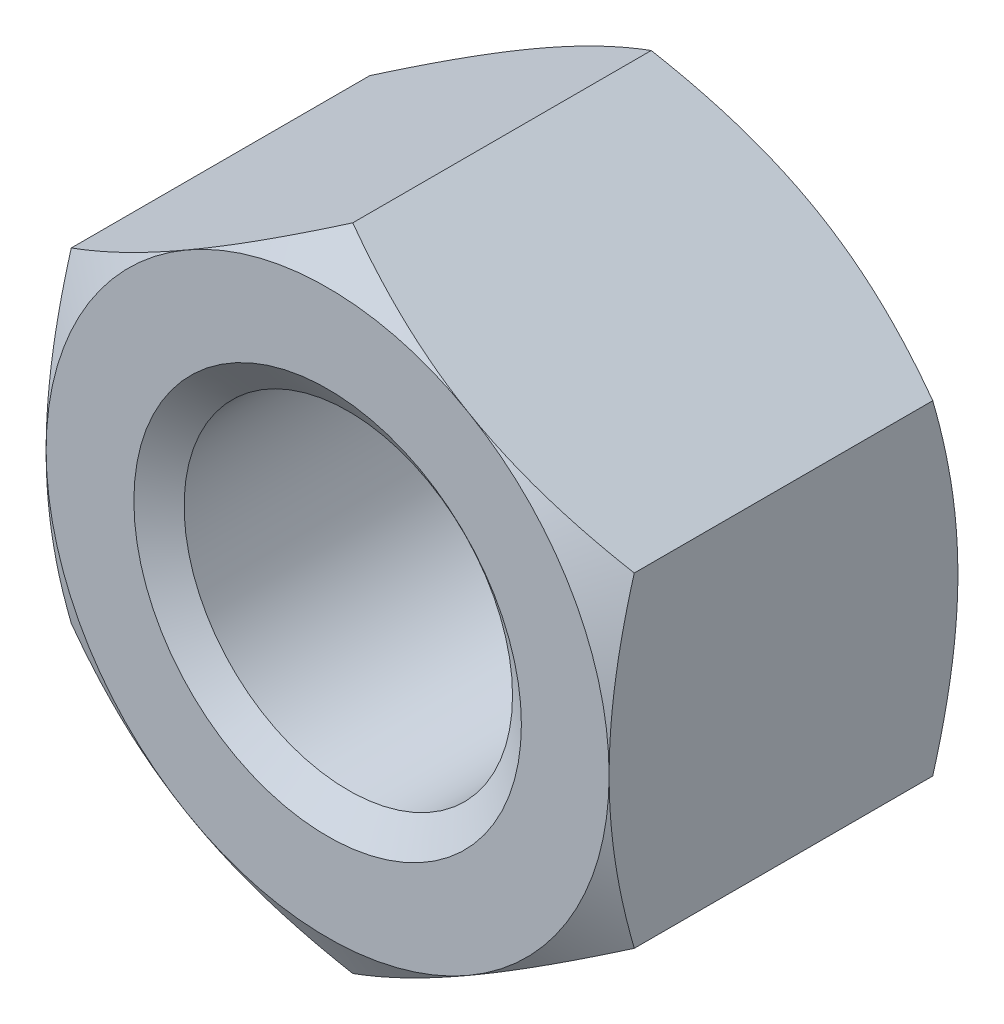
from build123d import *

# Parameters (mm, degrees)
BASENUTSKE_R  = 10.5
BASENUT_DEPTH = 22.3


with BuildPart() as part:
    # BaseNutSke → BaseNut (new body)
    with BuildSketch(Plane.XY):
        Polygon((18, 10.392304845), (18, -10.392304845), (0, -20.784609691), (-18, -10.392304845), (-18, 10.392304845), (0, 20.784609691), align=None)
        Circle(BASENUTSKE_R, mode=Mode.SUBTRACT)
    extrude(amount=-BASENUT_DEPTH)

    # Sketch3 → Double-Chamfer (revolve, cut)
    with BuildSketch(Plane(origin=(0, 0, 0), x_dir=(0, 0, -1), z_dir=(1, 0, 0))):
        Polygon((22.3, 18), (20.692304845, 20.784609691), (20.692304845, 30.784609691), (32.3, 30.784609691), (32.3, 18), align=None)
        Polygon((1.607695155, 30.784609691), (-10, 30.784609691), (-10, 18), (0, 18), (1.607695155, 20.784609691), align=None)
    revolve(axis=Axis((0, 0, 0), (0, 0, -1)), mode=Mode.SUBTRACT)

    # Sketch5 (on Right Plane) → EndChamfer (revolve, cut)
    with BuildSketch(Plane(origin=(0, 0, 0), x_dir=(0, 0, -1), z_dir=(1, 0, 0)), mode=Mode.PRIVATE) as endchamfer_sk:
        Polygon((22.3, 12.39), (20.976607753, 10.5), (22.3, 10.5), align=None)
        Polygon((0, 12.39), (1.323392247, 10.5), (0, 10.5), align=None)
    revolve(endchamfer_sk.sketch.rotate(Axis((0, 0, -25.037505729), (0, 0, -1)), 90), axis=Axis((0, 0, -25.037505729), (0, 0, -1)), mode=Mode.SUBTRACT)


solid = part.part
